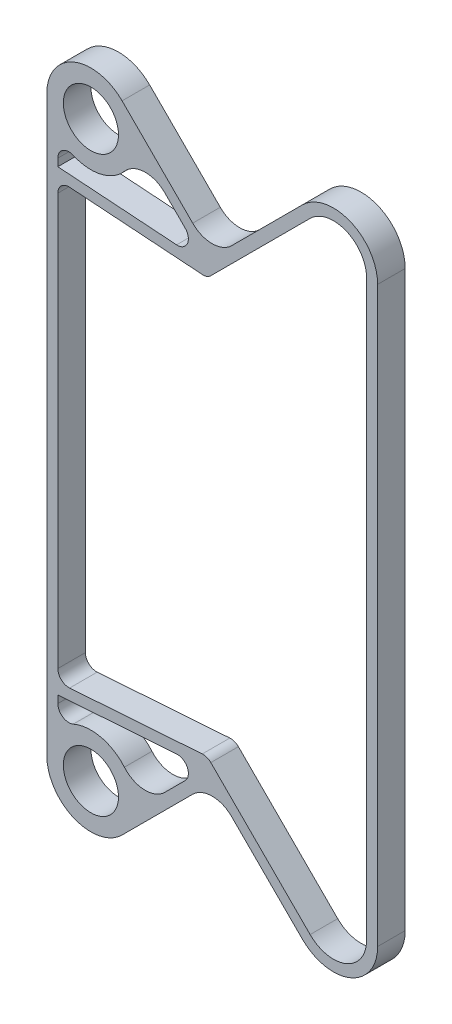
from build123d import *

# Parameters (mm, degrees)
ESQUISSE1_R        = 50
BOSS_EXTRU_1_DEPTH = 50


with BuildPart() as part:
    # Esquisse1 → Boss.-Extru.1 (new body)
    with BuildSketch(Plane.XY):
        with BuildLine():
            ThreePointArc((299.967205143, -517.709563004), (300, -520), (299.967205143, -522.290436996))
            ThreePointArc((299.967205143, -522.290436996), (324.181540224, -577.372619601), (379.934410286, -600))
            ThreePointArc((379.934410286, -600), (410.549084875, -593.910362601), (436.502952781, -576.568542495))
            Line((436.502952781, -576.568542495), (564.579071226, -448.492424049))
            ThreePointArc((564.579071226, -448.492424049), (599.934410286, -433.847763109), (635.289749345, -448.492424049))
            Line((635.289749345, -448.492424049), (763.365867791, -576.568542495))
            ThreePointArc((763.365867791, -576.568542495), (789.319735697, -593.910362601), (819.934410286, -600))
            ThreePointArc((819.934410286, -600), (876.502952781, -576.568542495), (899.934410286, -520))
            Line((899.934410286, -520), (899.934410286, 520))
            ThreePointArc((899.934410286, 520), (876.502952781, 576.568542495), (819.934410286, 600))
            ThreePointArc((819.934410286, 600), (789.319735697, 593.910362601), (763.365867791, 576.568542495))
            Line((763.365867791, 576.568542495), (635.289749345, 448.492424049))
            ThreePointArc((635.289749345, 448.492424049), (599.934410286, 433.847763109), (564.579071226, 448.492424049))
            Line((564.579071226, 448.492424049), (436.502952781, 576.568542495))
            ThreePointArc((436.502952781, 576.568542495), (410.549084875, 593.910362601), (379.934410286, 600))
            ThreePointArc((379.934410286, 600), (324.181540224, 577.372619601), (299.967205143, 522.290436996))
            ThreePointArc((299.967205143, 522.290436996), (300, 520), (299.967205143, 517.709563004))
            Line((299.967205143, 517.709563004), (299.967205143, -517.709563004))
        make_face()
        with Locations((379.934410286, -520)):
            Circle(ESQUISSE1_R, mode=Mode.SUBTRACT)
        with BuildLine():
            ThreePointArc((535.333797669, -399.829612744), (554.922303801, -411.490911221), (550.863679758, -433.92354427))
            Line((550.863679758, -433.92354427), (514.012331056, -470.774892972))
            ThreePointArc((514.012331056, -470.774892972), (476.732488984, -485.382503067), (440.686768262, -467.950494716))
            ThreePointArc((440.686768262, -467.950494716), (410.828099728, -446.205827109), (374.383424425, -440.192816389))
            ThreePointArc((374.383424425, -440.192816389), (360.894804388, -442.298691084), (347.960646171, -446.667344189))
            ThreePointArc((347.960646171, -446.667344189), (329.009760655, -445.065420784), (319.967205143, -428.334180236))
            Line((319.967205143, -428.334180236), (319.967205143, -414.809428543))
            Line((319.967205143, -414.809428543), (535.333797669, -399.829612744))
        make_face(mode=Mode.SUBTRACT)
        with BuildLine():
            Line((535.333797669, 399.829612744), (319.967205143, 414.809428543))
            Line((319.967205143, 414.809428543), (319.967205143, 428.334180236))
            ThreePointArc((319.967205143, 428.334180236), (329.009760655, 445.065420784), (347.960646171, 446.667344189))
            ThreePointArc((347.960646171, 446.667344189), (360.894804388, 442.298691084), (374.383424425, 440.192816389))
            ThreePointArc((374.383424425, 440.192816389), (410.828099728, 446.205827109), (440.686768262, 467.950494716))
            ThreePointArc((440.686768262, 467.950494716), (476.732488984, 485.382503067), (514.012331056, 470.774892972))
            Line((514.012331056, 470.774892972), (550.863679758, 433.92354427))
            ThreePointArc((550.863679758, 433.92354427), (554.922303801, 411.490911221), (535.333797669, 399.829612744))
        make_face(mode=Mode.SUBTRACT)
        with Locations((379.934410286, 520)):
            Circle(ESQUISSE1_R, mode=Mode.SUBTRACT)
        with BuildLine():
            ThreePointArc((879.934410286, -520), (842.895416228, -575.432771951), (777.508003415, -562.426406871))
            Line((777.508003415, -562.426406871), (597.433394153, -382.35179761))
            ThreePointArc((597.433394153, -382.35179761), (590.298872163, -377.761785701), (581.903512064, -376.542137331))
            Line((581.903512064, -376.542137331), (341.354951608, -393.273484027))
            ThreePointArc((341.354951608, -393.273484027), (326.324531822, -387.946238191), (319.967205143, -373.321688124))
            Line((319.967205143, -373.321688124), (319.967205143, 373.321688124))
            ThreePointArc((319.967205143, 373.321688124), (326.324531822, 387.946238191), (341.354951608, 393.273484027))
            Line((341.354951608, 393.273484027), (581.903512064, 376.542137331))
            ThreePointArc((581.903512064, 376.542137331), (590.298872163, 377.761785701), (597.433394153, 382.35179761))
            Line((597.433394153, 382.35179761), (777.508003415, 562.426406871))
            ThreePointArc((777.508003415, 562.426406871), (842.895416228, 575.432771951), (879.934410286, 520))
            Line((879.934410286, 520), (879.934410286, -520))
        make_face(mode=Mode.SUBTRACT)
    extrude(amount=BOSS_EXTRU_1_DEPTH)


solid = part.part
